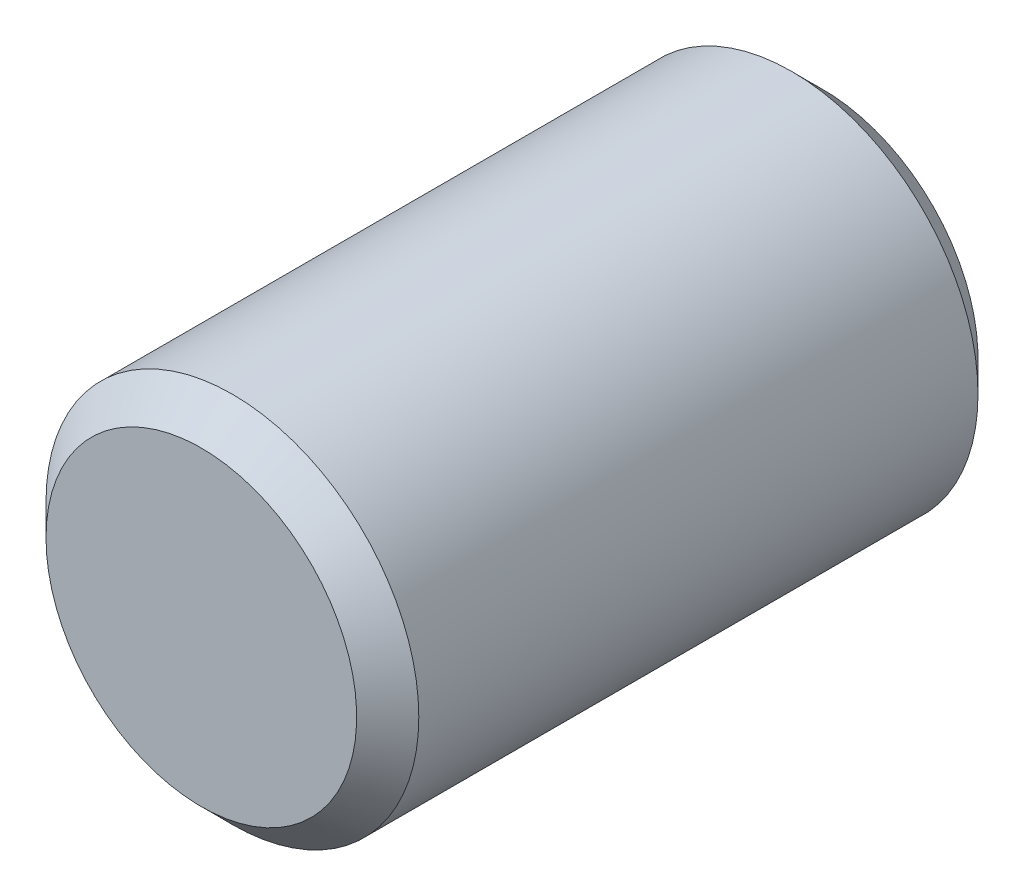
from build123d import *

# Parameters (mm, degrees)
EMPREINTE_DEPTH = 3.15


with BuildPart() as part:
    # E_corps → Corps (revolve)
    with BuildSketch(Plane(origin=(0, 0, 0), x_dir=(1, 0, 0), z_dir=(0, 1, 0)), mode=Mode.PRIVATE) as corps_sk:
        Polygon((0, 0), (2.5, 0), (3, -0.5), (3, -9.5), (2.5, -10), (0, -10), align=None)
    revolve(corps_sk.sketch.rotate(Axis((0, 0, -10), (0, 0, 1)), 180), axis=Axis((0, 0, -10), (0, 0, 1)))

    # E_empreinte → Empreinte (cut)
    with BuildSketch(Plane(origin=(0, 0, 0), x_dir=(-1, 0, 0), z_dir=(0, 0, -1))):
        Polygon((0, 1.72), (-1.489563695, 0.86), (-1.489563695, -0.86), (0, -1.72), (1.489563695, -0.86), (1.489563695, 0.86), align=None)
    extrude(amount=-EMPREINTE_DEPTH, mode=Mode.SUBTRACT)


solid = part.part
